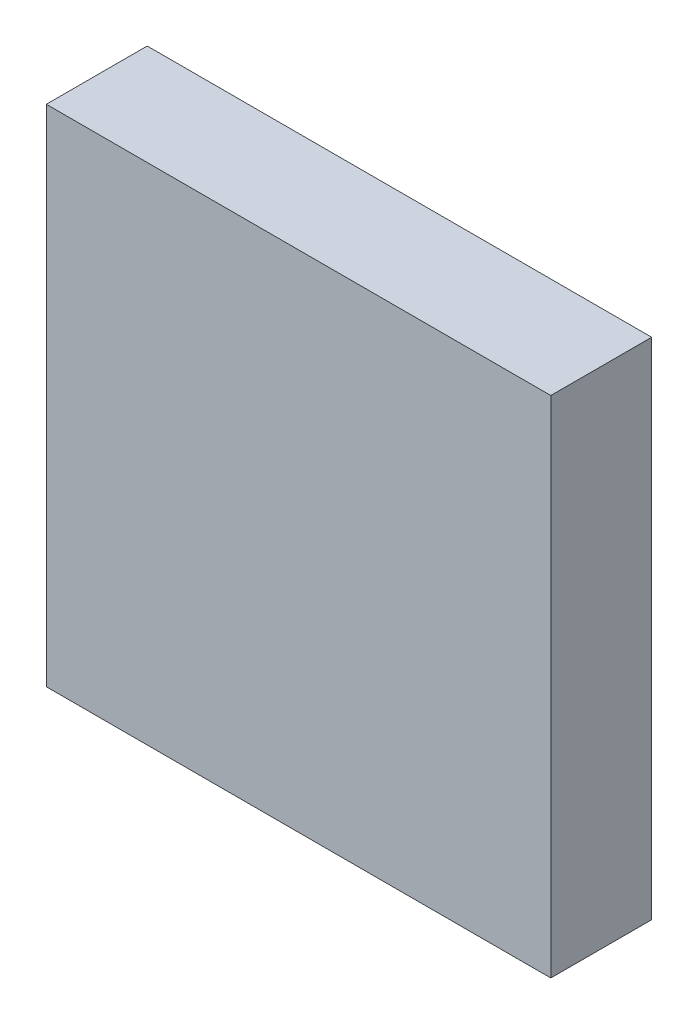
ISO-10303-21;
HEADER;
FILE_DESCRIPTION(('STEP AP214'),'2;1');
FILE_NAME('part.step','',(''),(''),'','','');
FILE_SCHEMA(('AUTOMOTIVE_DESIGN { 1 0 10303 214 1 1 1 1 }'));
ENDSEC;
DATA;
#1=APPLICATION_CONTEXT('core data for automotive mechanical design processes');
#2=APPLICATION_PROTOCOL_DEFINITION('international standard','automotive_design',2000,#1);
#3=PRODUCT_CONTEXT('',#1,'mechanical');
#4=PRODUCT('Part','Part','',(#3));
#5=PRODUCT_RELATED_PRODUCT_CATEGORY('part','',(#4));
#6=PRODUCT_DEFINITION_FORMATION('','',#4);
#7=PRODUCT_DEFINITION_CONTEXT('part definition',#1,'design');
#8=PRODUCT_DEFINITION('design','',#6,#7);
#9=PRODUCT_DEFINITION_SHAPE('','',#8);
#10=(LENGTH_UNIT() NAMED_UNIT(*) SI_UNIT(.MILLI.,.METRE.));
#11=(NAMED_UNIT(*) PLANE_ANGLE_UNIT() SI_UNIT($,.RADIAN.));
#12=(NAMED_UNIT(*) SI_UNIT($,.STERADIAN.) SOLID_ANGLE_UNIT());
#13=UNCERTAINTY_MEASURE_WITH_UNIT(LENGTH_MEASURE(1.E-05),#10,'distance_accuracy_value','');
#14=(GEOMETRIC_REPRESENTATION_CONTEXT(3) GLOBAL_UNCERTAINTY_ASSIGNED_CONTEXT((#13)) GLOBAL_UNIT_ASSIGNED_CONTEXT((#10,
#11,#12)) REPRESENTATION_CONTEXT('',''));
#15=CARTESIAN_POINT('',(0.,0.,0.));
#16=DIRECTION('',(0.,0.,1.));
#17=DIRECTION('',(1.,0.,0.));
#18=AXIS2_PLACEMENT_3D('',#15,#16,#17);
#19=CARTESIAN_POINT('',(0.,0.,20.));
#20=DIRECTION('',(0.,0.,1.));
#21=DIRECTION('',(1.,0.,0.));
#22=AXIS2_PLACEMENT_3D('',#19,#20,#21);
#23=PLANE('',#22);
#24=DIRECTION('',(1.,0.,0.));
#25=VECTOR('',#24,1.);
#26=CARTESIAN_POINT('',(-50.,-50.,20.));
#27=LINE('',#26,#25);
#28=CARTESIAN_POINT('',(-50.,-50.,20.));
#29=VERTEX_POINT('',#28);
#30=CARTESIAN_POINT('',(50.,-50.,20.));
#31=VERTEX_POINT('',#30);
#32=EDGE_CURVE('E81',#29,#31,#27,.T.);
#33=ORIENTED_EDGE('',*,*,#32,.T.);
#34=DIRECTION('',(0.,1.,0.));
#35=VECTOR('',#34,1.);
#36=CARTESIAN_POINT('',(50.,-50.,20.));
#37=LINE('',#36,#35);
#38=CARTESIAN_POINT('',(50.,50.,20.));
#39=VERTEX_POINT('',#38);
#40=EDGE_CURVE('E101',#31,#39,#37,.T.);
#41=ORIENTED_EDGE('',*,*,#40,.T.);
#42=DIRECTION('',(-1.,0.,0.));
#43=VECTOR('',#42,1.);
#44=CARTESIAN_POINT('',(50.,50.,20.));
#45=LINE('',#44,#43);
#46=CARTESIAN_POINT('',(-50.,50.,20.));
#47=VERTEX_POINT('',#46);
#48=EDGE_CURVE('E74',#39,#47,#45,.T.);
#49=ORIENTED_EDGE('',*,*,#48,.T.);
#50=DIRECTION('',(0.,-1.,0.));
#51=VECTOR('',#50,1.);
#52=CARTESIAN_POINT('',(-50.,50.,20.));
#53=LINE('',#52,#51);
#54=EDGE_CURVE('E10',#47,#29,#53,.T.);
#55=ORIENTED_EDGE('',*,*,#54,.T.);
#56=EDGE_LOOP('',(#33,#41,#49,#55));
#57=FACE_BOUND('',#56,.T.);
#58=ADVANCED_FACE('F16',(#57),#23,.T.);
#59=CARTESIAN_POINT('',(0.,0.,0.));
#60=DIRECTION('',(0.,0.,1.));
#61=DIRECTION('',(1.,0.,0.));
#62=AXIS2_PLACEMENT_3D('',#59,#60,#61);
#63=PLANE('',#62);
#64=DIRECTION('',(0.,-1.,0.));
#65=VECTOR('',#64,1.);
#66=CARTESIAN_POINT('',(-50.,50.,0.));
#67=LINE('',#66,#65);
#68=CARTESIAN_POINT('',(-50.,50.,0.));
#69=VERTEX_POINT('',#68);
#70=CARTESIAN_POINT('',(-50.,-50.,0.));
#71=VERTEX_POINT('',#70);
#72=EDGE_CURVE('E25',#69,#71,#67,.T.);
#73=ORIENTED_EDGE('',*,*,#72,.F.);
#74=DIRECTION('',(-1.,0.,0.));
#75=VECTOR('',#74,1.);
#76=CARTESIAN_POINT('',(50.,50.,0.));
#77=LINE('',#76,#75);
#78=CARTESIAN_POINT('',(50.,50.,0.));
#79=VERTEX_POINT('',#78);
#80=EDGE_CURVE('E105',#79,#69,#77,.T.);
#81=ORIENTED_EDGE('',*,*,#80,.F.);
#82=DIRECTION('',(0.,1.,0.));
#83=VECTOR('',#82,1.);
#84=CARTESIAN_POINT('',(50.,-50.,0.));
#85=LINE('',#84,#83);
#86=CARTESIAN_POINT('',(50.,-50.,0.));
#87=VERTEX_POINT('',#86);
#88=EDGE_CURVE('E83',#87,#79,#85,.T.);
#89=ORIENTED_EDGE('',*,*,#88,.F.);
#90=DIRECTION('',(1.,0.,0.));
#91=VECTOR('',#90,1.);
#92=CARTESIAN_POINT('',(-50.,-50.,0.));
#93=LINE('',#92,#91);
#94=EDGE_CURVE('E79',#71,#87,#93,.T.);
#95=ORIENTED_EDGE('',*,*,#94,.F.);
#96=EDGE_LOOP('',(#73,#81,#89,#95));
#97=FACE_BOUND('',#96,.T.);
#98=ADVANCED_FACE('F18',(#97),#63,.F.);
#99=CARTESIAN_POINT('',(-50.,50.,0.));
#100=DIRECTION('',(1.,0.,0.));
#101=DIRECTION('',(0.,1.,0.));
#102=AXIS2_PLACEMENT_3D('',#99,#100,#101);
#103=PLANE('',#102);
#104=ORIENTED_EDGE('',*,*,#72,.T.);
#105=DIRECTION('',(0.,0.,1.));
#106=VECTOR('',#105,1.);
#107=CARTESIAN_POINT('',(-50.,-50.,0.));
#108=LINE('',#107,#106);
#109=EDGE_CURVE('E68',#71,#29,#108,.T.);
#110=ORIENTED_EDGE('',*,*,#109,.T.);
#111=ORIENTED_EDGE('',*,*,#54,.F.);
#112=DIRECTION('',(0.,0.,1.));
#113=VECTOR('',#112,1.);
#114=CARTESIAN_POINT('',(-50.,50.,0.));
#115=LINE('',#114,#113);
#116=EDGE_CURVE('E71',#69,#47,#115,.T.);
#117=ORIENTED_EDGE('',*,*,#116,.F.);
#118=EDGE_LOOP('',(#104,#110,#111,#117));
#119=FACE_BOUND('',#118,.T.);
#120=ADVANCED_FACE('F67',(#119),#103,.F.);
#121=CARTESIAN_POINT('',(50.,50.,0.));
#122=DIRECTION('',(0.,-1.,0.));
#123=DIRECTION('',(0.,0.,-1.));
#124=AXIS2_PLACEMENT_3D('',#121,#122,#123);
#125=PLANE('',#124);
#126=ORIENTED_EDGE('',*,*,#80,.T.);
#127=ORIENTED_EDGE('',*,*,#116,.T.);
#128=ORIENTED_EDGE('',*,*,#48,.F.);
#129=DIRECTION('',(0.,0.,1.));
#130=VECTOR('',#129,1.);
#131=CARTESIAN_POINT('',(50.,50.,0.));
#132=LINE('',#131,#130);
#133=EDGE_CURVE('E100',#79,#39,#132,.T.);
#134=ORIENTED_EDGE('',*,*,#133,.F.);
#135=EDGE_LOOP('',(#126,#127,#128,#134));
#136=FACE_BOUND('',#135,.T.);
#137=ADVANCED_FACE('F117',(#136),#125,.F.);
#138=CARTESIAN_POINT('',(50.,-50.,0.));
#139=DIRECTION('',(-1.,0.,0.));
#140=DIRECTION('',(0.,0.,1.));
#141=AXIS2_PLACEMENT_3D('',#138,#139,#140);
#142=PLANE('',#141);
#143=ORIENTED_EDGE('',*,*,#88,.T.);
#144=ORIENTED_EDGE('',*,*,#133,.T.);
#145=ORIENTED_EDGE('',*,*,#40,.F.);
#146=DIRECTION('',(0.,0.,1.));
#147=VECTOR('',#146,1.);
#148=CARTESIAN_POINT('',(50.,-50.,0.));
#149=LINE('',#148,#147);
#150=EDGE_CURVE('E88',#87,#31,#149,.T.);
#151=ORIENTED_EDGE('',*,*,#150,.F.);
#152=EDGE_LOOP('',(#143,#144,#145,#151));
#153=FACE_BOUND('',#152,.T.);
#154=ADVANCED_FACE('F119',(#153),#142,.F.);
#155=CARTESIAN_POINT('',(-50.,-50.,0.));
#156=DIRECTION('',(0.,1.,0.));
#157=DIRECTION('',(1.,0.,0.));
#158=AXIS2_PLACEMENT_3D('',#155,#156,#157);
#159=PLANE('',#158);
#160=ORIENTED_EDGE('',*,*,#94,.T.);
#161=ORIENTED_EDGE('',*,*,#150,.T.);
#162=ORIENTED_EDGE('',*,*,#32,.F.);
#163=ORIENTED_EDGE('',*,*,#109,.F.);
#164=EDGE_LOOP('',(#160,#161,#162,#163));
#165=FACE_BOUND('',#164,.T.);
#166=ADVANCED_FACE('F77',(#165),#159,.F.);
#167=CLOSED_SHELL('',(#58,#98,#120,#137,#154,#166));
#168=MANIFOLD_SOLID_BREP('B1',#167);
#169=ADVANCED_BREP_SHAPE_REPRESENTATION('',(#18,#168),#14);
#170=SHAPE_DEFINITION_REPRESENTATION(#9,#169);
ENDSEC;
END-ISO-10303-21;
